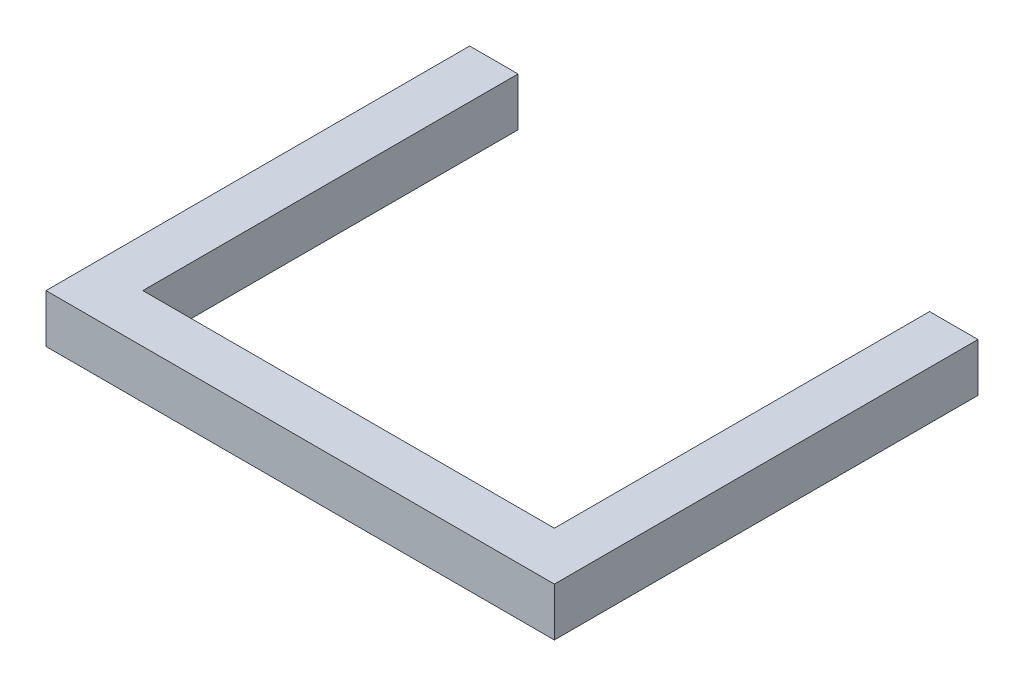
ISO-10303-21;
HEADER;
FILE_DESCRIPTION(('STEP AP214'),'2;1');
FILE_NAME('part.step','',(''),(''),'','','');
FILE_SCHEMA(('AUTOMOTIVE_DESIGN { 1 0 10303 214 1 1 1 1 }'));
ENDSEC;
DATA;
#1=APPLICATION_CONTEXT('core data for automotive mechanical design processes');
#2=APPLICATION_PROTOCOL_DEFINITION('international standard','automotive_design',2000,#1);
#3=PRODUCT_CONTEXT('',#1,'mechanical');
#4=PRODUCT('Part','Part','',(#3));
#5=PRODUCT_RELATED_PRODUCT_CATEGORY('part','',(#4));
#6=PRODUCT_DEFINITION_FORMATION('','',#4);
#7=PRODUCT_DEFINITION_CONTEXT('part definition',#1,'design');
#8=PRODUCT_DEFINITION('design','',#6,#7);
#9=PRODUCT_DEFINITION_SHAPE('','',#8);
#10=(LENGTH_UNIT() NAMED_UNIT(*) SI_UNIT(.MILLI.,.METRE.));
#11=(NAMED_UNIT(*) PLANE_ANGLE_UNIT() SI_UNIT($,.RADIAN.));
#12=(NAMED_UNIT(*) SI_UNIT($,.STERADIAN.) SOLID_ANGLE_UNIT());
#13=UNCERTAINTY_MEASURE_WITH_UNIT(LENGTH_MEASURE(1.E-05),#10,'distance_accuracy_value','');
#14=(GEOMETRIC_REPRESENTATION_CONTEXT(3) GLOBAL_UNCERTAINTY_ASSIGNED_CONTEXT((#13)) GLOBAL_UNIT_ASSIGNED_CONTEXT((#10,
#11,#12)) REPRESENTATION_CONTEXT('',''));
#15=CARTESIAN_POINT('',(0.,0.,0.));
#16=DIRECTION('',(0.,0.,1.));
#17=DIRECTION('',(1.,0.,0.));
#18=AXIS2_PLACEMENT_3D('',#15,#16,#17);
#19=CARTESIAN_POINT('',(84.9999999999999,20.,0.));
#20=DIRECTION('',(-1.,0.,0.));
#21=DIRECTION('',(0.,0.,1.));
#22=AXIS2_PLACEMENT_3D('',#19,#20,#21);
#23=PLANE('',#22);
#24=DIRECTION('',(0.,0.,-1.));
#25=VECTOR('',#24,1.);
#26=CARTESIAN_POINT('',(84.9999999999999,0.,0.));
#27=LINE('',#26,#25);
#28=CARTESIAN_POINT('',(85.,0.,67.5));
#29=VERTEX_POINT('',#28);
#30=CARTESIAN_POINT('',(85.,0.,-87.5));
#31=VERTEX_POINT('',#30);
#32=EDGE_CURVE('E128',#29,#31,#27,.T.);
#33=ORIENTED_EDGE('',*,*,#32,.F.);
#34=DIRECTION('',(0.,-1.,0.));
#35=VECTOR('',#34,1.);
#36=CARTESIAN_POINT('',(85.,20.,67.5));
#37=LINE('',#36,#35);
#38=CARTESIAN_POINT('',(85.,20.,67.5));
#39=VERTEX_POINT('',#38);
#40=EDGE_CURVE('E11',#39,#29,#37,.T.);
#41=ORIENTED_EDGE('',*,*,#40,.F.);
#42=DIRECTION('',(0.,0.,-1.));
#43=VECTOR('',#42,1.);
#44=CARTESIAN_POINT('',(84.9999999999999,20.,0.));
#45=LINE('',#44,#43);
#46=CARTESIAN_POINT('',(85.,20.,-87.5));
#47=VERTEX_POINT('',#46);
#48=EDGE_CURVE('E171',#39,#47,#45,.T.);
#49=ORIENTED_EDGE('',*,*,#48,.T.);
#50=DIRECTION('',(0.,-1.,0.));
#51=VECTOR('',#50,1.);
#52=CARTESIAN_POINT('',(85.,20.,-87.5));
#53=LINE('',#52,#51);
#54=EDGE_CURVE('E49',#47,#31,#53,.T.);
#55=ORIENTED_EDGE('',*,*,#54,.T.);
#56=EDGE_LOOP('',(#33,#41,#49,#55));
#57=FACE_BOUND('',#56,.T.);
#58=ADVANCED_FACE('F33',(#57),#23,.T.);
#59=CARTESIAN_POINT('',(0.,20.,67.5));
#60=DIRECTION('',(0.,0.,-1.));
#61=DIRECTION('',(-1.,0.,0.));
#62=AXIS2_PLACEMENT_3D('',#59,#60,#61);
#63=PLANE('',#62);
#64=DIRECTION('',(1.,0.,0.));
#65=VECTOR('',#64,1.);
#66=CARTESIAN_POINT('',(0.,0.,67.5));
#67=LINE('',#66,#65);
#68=CARTESIAN_POINT('',(-85.,0.,67.5));
#69=VERTEX_POINT('',#68);
#70=EDGE_CURVE('E130',#69,#29,#67,.T.);
#71=ORIENTED_EDGE('',*,*,#70,.F.);
#72=DIRECTION('',(0.,-1.,0.));
#73=VECTOR('',#72,1.);
#74=CARTESIAN_POINT('',(-85.,20.,67.5));
#75=LINE('',#74,#73);
#76=CARTESIAN_POINT('',(-85.,20.,67.5));
#77=VERTEX_POINT('',#76);
#78=EDGE_CURVE('E41',#77,#69,#75,.T.);
#79=ORIENTED_EDGE('',*,*,#78,.F.);
#80=DIRECTION('',(1.,0.,0.));
#81=VECTOR('',#80,1.);
#82=CARTESIAN_POINT('',(0.,20.,67.5));
#83=LINE('',#82,#81);
#84=EDGE_CURVE('E169',#77,#39,#83,.T.);
#85=ORIENTED_EDGE('',*,*,#84,.T.);
#86=ORIENTED_EDGE('',*,*,#40,.T.);
#87=EDGE_LOOP('',(#71,#79,#85,#86));
#88=FACE_BOUND('',#87,.T.);
#89=ADVANCED_FACE('F161',(#88),#63,.T.);
#90=CARTESIAN_POINT('',(-85.,20.,0.));
#91=DIRECTION('',(1.,0.,0.));
#92=DIRECTION('',(0.,0.,-1.));
#93=AXIS2_PLACEMENT_3D('',#90,#91,#92);
#94=PLANE('',#93);
#95=DIRECTION('',(0.,0.,1.));
#96=VECTOR('',#95,1.);
#97=CARTESIAN_POINT('',(-85.,0.,0.));
#98=LINE('',#97,#96);
#99=CARTESIAN_POINT('',(-85.,0.,-87.5));
#100=VERTEX_POINT('',#99);
#101=EDGE_CURVE('E133',#100,#69,#98,.T.);
#102=ORIENTED_EDGE('',*,*,#101,.F.);
#103=DIRECTION('',(0.,-1.,0.));
#104=VECTOR('',#103,1.);
#105=CARTESIAN_POINT('',(-85.,20.,-87.5));
#106=LINE('',#105,#104);
#107=CARTESIAN_POINT('',(-85.,20.,-87.5));
#108=VERTEX_POINT('',#107);
#109=EDGE_CURVE('E150',#108,#100,#106,.T.);
#110=ORIENTED_EDGE('',*,*,#109,.F.);
#111=DIRECTION('',(0.,0.,1.));
#112=VECTOR('',#111,1.);
#113=CARTESIAN_POINT('',(-85.,20.,0.));
#114=LINE('',#113,#112);
#115=EDGE_CURVE('E157',#108,#77,#114,.T.);
#116=ORIENTED_EDGE('',*,*,#115,.T.);
#117=ORIENTED_EDGE('',*,*,#78,.T.);
#118=EDGE_LOOP('',(#102,#110,#116,#117));
#119=FACE_BOUND('',#118,.T.);
#120=ADVANCED_FACE('F155',(#119),#94,.T.);
#121=CARTESIAN_POINT('',(0.,20.,-87.5));
#122=DIRECTION('',(0.,0.,-1.));
#123=DIRECTION('',(-1.,0.,0.));
#124=AXIS2_PLACEMENT_3D('',#121,#122,#123);
#125=PLANE('',#124);
#126=DIRECTION('',(1.,0.,0.));
#127=VECTOR('',#126,1.);
#128=CARTESIAN_POINT('',(0.,0.,-87.5));
#129=LINE('',#128,#127);
#130=CARTESIAN_POINT('',(-105.,0.,-87.5));
#131=VERTEX_POINT('',#130);
#132=EDGE_CURVE('E136',#131,#100,#129,.T.);
#133=ORIENTED_EDGE('',*,*,#132,.F.);
#134=DIRECTION('',(0.,-1.,0.));
#135=VECTOR('',#134,1.);
#136=CARTESIAN_POINT('',(-105.,20.,-87.5));
#137=LINE('',#136,#135);
#138=CARTESIAN_POINT('',(-105.,20.,-87.5));
#139=VERTEX_POINT('',#138);
#140=EDGE_CURVE('E148',#139,#131,#137,.T.);
#141=ORIENTED_EDGE('',*,*,#140,.F.);
#142=DIRECTION('',(1.,0.,0.));
#143=VECTOR('',#142,1.);
#144=CARTESIAN_POINT('',(0.,20.,-87.5));
#145=LINE('',#144,#143);
#146=EDGE_CURVE('E125',#139,#108,#145,.T.);
#147=ORIENTED_EDGE('',*,*,#146,.T.);
#148=ORIENTED_EDGE('',*,*,#109,.T.);
#149=EDGE_LOOP('',(#133,#141,#147,#148));
#150=FACE_BOUND('',#149,.T.);
#151=ADVANCED_FACE('F167',(#150),#125,.T.);
#152=CARTESIAN_POINT('',(-105.,20.,0.));
#153=DIRECTION('',(1.,0.,0.));
#154=DIRECTION('',(0.,0.,-1.));
#155=AXIS2_PLACEMENT_3D('',#152,#153,#154);
#156=PLANE('',#155);
#157=DIRECTION('',(0.,0.,1.));
#158=VECTOR('',#157,1.);
#159=CARTESIAN_POINT('',(-105.,0.,0.));
#160=LINE('',#159,#158);
#161=CARTESIAN_POINT('',(-105.,0.,87.5));
#162=VERTEX_POINT('',#161);
#163=EDGE_CURVE('E139',#131,#162,#160,.T.);
#164=ORIENTED_EDGE('',*,*,#163,.T.);
#165=DIRECTION('',(0.,-1.,0.));
#166=VECTOR('',#165,1.);
#167=CARTESIAN_POINT('',(-105.,20.,87.5));
#168=LINE('',#167,#166);
#169=CARTESIAN_POINT('',(-105.,20.,87.5));
#170=VERTEX_POINT('',#169);
#171=EDGE_CURVE('E119',#170,#162,#168,.T.);
#172=ORIENTED_EDGE('',*,*,#171,.F.);
#173=DIRECTION('',(0.,0.,1.));
#174=VECTOR('',#173,1.);
#175=CARTESIAN_POINT('',(-105.,20.,0.));
#176=LINE('',#175,#174);
#177=EDGE_CURVE('E107',#139,#170,#176,.T.);
#178=ORIENTED_EDGE('',*,*,#177,.F.);
#179=ORIENTED_EDGE('',*,*,#140,.T.);
#180=EDGE_LOOP('',(#164,#172,#178,#179));
#181=FACE_BOUND('',#180,.T.);
#182=ADVANCED_FACE('F186',(#181),#156,.F.);
#183=CARTESIAN_POINT('',(0.,20.,87.5));
#184=DIRECTION('',(0.,0.,-1.));
#185=DIRECTION('',(-1.,0.,0.));
#186=AXIS2_PLACEMENT_3D('',#183,#184,#185);
#187=PLANE('',#186);
#188=DIRECTION('',(1.,0.,0.));
#189=VECTOR('',#188,1.);
#190=CARTESIAN_POINT('',(0.,0.,87.5));
#191=LINE('',#190,#189);
#192=CARTESIAN_POINT('',(105.,0.,87.5));
#193=VERTEX_POINT('',#192);
#194=EDGE_CURVE('E116',#162,#193,#191,.T.);
#195=ORIENTED_EDGE('',*,*,#194,.T.);
#196=DIRECTION('',(0.,-1.,0.));
#197=VECTOR('',#196,1.);
#198=CARTESIAN_POINT('',(105.,20.,87.5));
#199=LINE('',#198,#197);
#200=CARTESIAN_POINT('',(105.,20.,87.5));
#201=VERTEX_POINT('',#200);
#202=EDGE_CURVE('E113',#201,#193,#199,.T.);
#203=ORIENTED_EDGE('',*,*,#202,.F.);
#204=DIRECTION('',(1.,0.,0.));
#205=VECTOR('',#204,1.);
#206=CARTESIAN_POINT('',(0.,20.,87.5));
#207=LINE('',#206,#205);
#208=EDGE_CURVE('E99',#170,#201,#207,.T.);
#209=ORIENTED_EDGE('',*,*,#208,.F.);
#210=ORIENTED_EDGE('',*,*,#171,.T.);
#211=EDGE_LOOP('',(#195,#203,#209,#210));
#212=FACE_BOUND('',#211,.T.);
#213=ADVANCED_FACE('F114',(#212),#187,.F.);
#214=CARTESIAN_POINT('',(105.,20.,0.));
#215=DIRECTION('',(1.,0.,0.));
#216=DIRECTION('',(0.,0.,-1.));
#217=AXIS2_PLACEMENT_3D('',#214,#215,#216);
#218=PLANE('',#217);
#219=DIRECTION('',(0.,0.,1.));
#220=VECTOR('',#219,1.);
#221=CARTESIAN_POINT('',(105.,0.,0.));
#222=LINE('',#221,#220);
#223=CARTESIAN_POINT('',(105.,0.,-87.5));
#224=VERTEX_POINT('',#223);
#225=EDGE_CURVE('E143',#224,#193,#222,.T.);
#226=ORIENTED_EDGE('',*,*,#225,.F.);
#227=DIRECTION('',(0.,-1.,0.));
#228=VECTOR('',#227,1.);
#229=CARTESIAN_POINT('',(105.,20.,-87.5));
#230=LINE('',#229,#228);
#231=CARTESIAN_POINT('',(105.,20.,-87.5));
#232=VERTEX_POINT('',#231);
#233=EDGE_CURVE('E74',#232,#224,#230,.T.);
#234=ORIENTED_EDGE('',*,*,#233,.F.);
#235=DIRECTION('',(0.,0.,1.));
#236=VECTOR('',#235,1.);
#237=CARTESIAN_POINT('',(105.,20.,0.));
#238=LINE('',#237,#236);
#239=EDGE_CURVE('E104',#232,#201,#238,.T.);
#240=ORIENTED_EDGE('',*,*,#239,.T.);
#241=ORIENTED_EDGE('',*,*,#202,.T.);
#242=EDGE_LOOP('',(#226,#234,#240,#241));
#243=FACE_BOUND('',#242,.T.);
#244=ADVANCED_FACE('F121',(#243),#218,.T.);
#245=EDGE_CURVE('E140',#31,#224,#129,.T.);
#246=ORIENTED_EDGE('',*,*,#245,.F.);
#247=ORIENTED_EDGE('',*,*,#54,.F.);
#248=EDGE_CURVE('E122',#47,#232,#145,.T.);
#249=ORIENTED_EDGE('',*,*,#248,.T.);
#250=ORIENTED_EDGE('',*,*,#233,.T.);
#251=EDGE_LOOP('',(#246,#247,#249,#250));
#252=FACE_BOUND('',#251,.T.);
#253=ADVANCED_FACE('F175',(#252),#125,.T.);
#254=CARTESIAN_POINT('',(0.,20.,0.));
#255=DIRECTION('',(0.,1.,0.));
#256=DIRECTION('',(0.,0.,1.));
#257=AXIS2_PLACEMENT_3D('',#254,#255,#256);
#258=PLANE('',#257);
#259=ORIENTED_EDGE('',*,*,#48,.F.);
#260=ORIENTED_EDGE('',*,*,#84,.F.);
#261=ORIENTED_EDGE('',*,*,#115,.F.);
#262=ORIENTED_EDGE('',*,*,#146,.F.);
#263=ORIENTED_EDGE('',*,*,#177,.T.);
#264=ORIENTED_EDGE('',*,*,#208,.T.);
#265=ORIENTED_EDGE('',*,*,#239,.F.);
#266=ORIENTED_EDGE('',*,*,#248,.F.);
#267=EDGE_LOOP('',(#259,#260,#261,#262,#263,#264,#265,#266));
#268=FACE_BOUND('',#267,.T.);
#269=ADVANCED_FACE('F101',(#268),#258,.T.);
#270=CARTESIAN_POINT('',(0.,0.,0.));
#271=DIRECTION('',(0.,1.,0.));
#272=DIRECTION('',(0.,0.,1.));
#273=AXIS2_PLACEMENT_3D('',#270,#271,#272);
#274=PLANE('',#273);
#275=ORIENTED_EDGE('',*,*,#32,.T.);
#276=ORIENTED_EDGE('',*,*,#245,.T.);
#277=ORIENTED_EDGE('',*,*,#225,.T.);
#278=ORIENTED_EDGE('',*,*,#194,.F.);
#279=ORIENTED_EDGE('',*,*,#163,.F.);
#280=ORIENTED_EDGE('',*,*,#132,.T.);
#281=ORIENTED_EDGE('',*,*,#101,.T.);
#282=ORIENTED_EDGE('',*,*,#70,.T.);
#283=EDGE_LOOP('',(#275,#276,#277,#278,#279,#280,#281,#282));
#284=FACE_BOUND('',#283,.T.);
#285=ADVANCED_FACE('F163',(#284),#274,.F.);
#286=CLOSED_SHELL('',(#58,#89,#120,#151,#182,#213,#244,#253,#269,#285));
#287=MANIFOLD_SOLID_BREP('B2',#286);
#288=ADVANCED_BREP_SHAPE_REPRESENTATION('',(#18,#287),#14);
#289=SHAPE_DEFINITION_REPRESENTATION(#9,#288);
ENDSEC;
END-ISO-10303-21;
